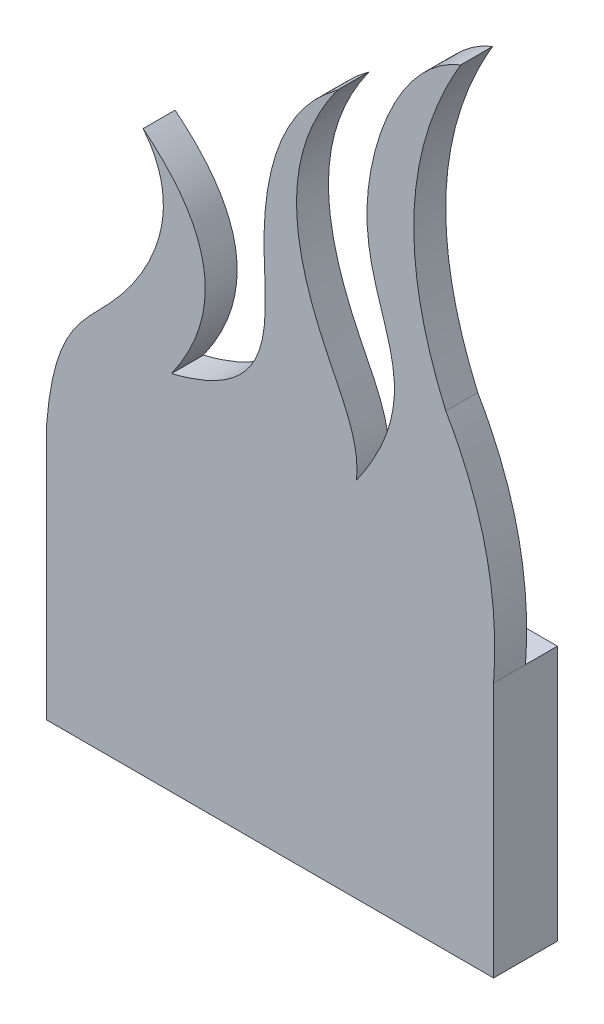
ISO-10303-21;
HEADER;
FILE_DESCRIPTION(('STEP AP214'),'2;1');
FILE_NAME('part.step','',(''),(''),'','','');
FILE_SCHEMA(('AUTOMOTIVE_DESIGN { 1 0 10303 214 1 1 1 1 }'));
ENDSEC;
DATA;
#1=APPLICATION_CONTEXT('core data for automotive mechanical design processes');
#2=APPLICATION_PROTOCOL_DEFINITION('international standard','automotive_design',2000,#1);
#3=PRODUCT_CONTEXT('',#1,'mechanical');
#4=PRODUCT('Part','Part','',(#3));
#5=PRODUCT_RELATED_PRODUCT_CATEGORY('part','',(#4));
#6=PRODUCT_DEFINITION_FORMATION('','',#4);
#7=PRODUCT_DEFINITION_CONTEXT('part definition',#1,'design');
#8=PRODUCT_DEFINITION('design','',#6,#7);
#9=PRODUCT_DEFINITION_SHAPE('','',#8);
#10=(LENGTH_UNIT() NAMED_UNIT(*) SI_UNIT(.MILLI.,.METRE.));
#11=(NAMED_UNIT(*) PLANE_ANGLE_UNIT() SI_UNIT($,.RADIAN.));
#12=(NAMED_UNIT(*) SI_UNIT($,.STERADIAN.) SOLID_ANGLE_UNIT());
#13=UNCERTAINTY_MEASURE_WITH_UNIT(LENGTH_MEASURE(1.E-05),#10,'distance_accuracy_value','');
#14=(GEOMETRIC_REPRESENTATION_CONTEXT(3) GLOBAL_UNCERTAINTY_ASSIGNED_CONTEXT((#13)) GLOBAL_UNIT_ASSIGNED_CONTEXT((#10,
#11,#12)) REPRESENTATION_CONTEXT('',''));
#15=CARTESIAN_POINT('',(0.,0.,0.));
#16=DIRECTION('',(0.,0.,1.));
#17=DIRECTION('',(1.,0.,0.));
#18=AXIS2_PLACEMENT_3D('',#15,#16,#17);
#19=CARTESIAN_POINT('',(22.225,25.4,3.175));
#20=DIRECTION('',(-1.,0.,0.));
#21=DIRECTION('',(0.,0.,1.));
#22=AXIS2_PLACEMENT_3D('',#19,#20,#21);
#23=PLANE('',#22);
#24=DIRECTION('',(0.,0.,-1.));
#25=VECTOR('',#24,1.);
#26=CARTESIAN_POINT('',(22.225,0.,3.175));
#27=LINE('',#26,#25);
#28=CARTESIAN_POINT('',(22.225,0.,3.175));
#29=VERTEX_POINT('',#28);
#30=CARTESIAN_POINT('',(22.225,0.,-3.175));
#31=VERTEX_POINT('',#30);
#32=EDGE_CURVE('E97',#29,#31,#27,.T.);
#33=ORIENTED_EDGE('',*,*,#32,.T.);
#34=DIRECTION('',(0.,-1.,0.));
#35=VECTOR('',#34,1.);
#36=CARTESIAN_POINT('',(22.225,25.4,-3.175));
#37=LINE('',#36,#35);
#38=CARTESIAN_POINT('',(22.225,25.4,-3.175));
#39=VERTEX_POINT('',#38);
#40=EDGE_CURVE('E11',#39,#31,#37,.T.);
#41=ORIENTED_EDGE('',*,*,#40,.F.);
#42=DIRECTION('',(0.,0.,-1.));
#43=VECTOR('',#42,1.);
#44=CARTESIAN_POINT('',(22.225,25.4,3.175));
#45=LINE('',#44,#43);
#46=CARTESIAN_POINT('',(22.225,25.4,0.));
#47=VERTEX_POINT('',#46);
#48=EDGE_CURVE('E91',#47,#39,#45,.T.);
#49=ORIENTED_EDGE('',*,*,#48,.F.);
#50=CARTESIAN_POINT('',(22.225,25.4,3.175));
#51=VERTEX_POINT('',#50);
#52=EDGE_CURVE('E99',#51,#47,#45,.T.);
#53=ORIENTED_EDGE('',*,*,#52,.F.);
#54=DIRECTION('',(0.,-1.,0.));
#55=VECTOR('',#54,1.);
#56=CARTESIAN_POINT('',(22.225,25.4,3.175));
#57=LINE('',#56,#55);
#58=EDGE_CURVE('E83',#51,#29,#57,.T.);
#59=ORIENTED_EDGE('',*,*,#58,.T.);
#60=EDGE_LOOP('',(#33,#41,#49,#53,#59));
#61=FACE_BOUND('',#60,.T.);
#62=ADVANCED_FACE('F32',(#61),#23,.F.);
#63=CARTESIAN_POINT('',(-22.225,25.4,-3.175));
#64=DIRECTION('',(0.,0.,1.));
#65=DIRECTION('',(1.,0.,0.));
#66=AXIS2_PLACEMENT_3D('',#63,#64,#65);
#67=PLANE('',#66);
#68=DIRECTION('',(-1.,0.,0.));
#69=VECTOR('',#68,1.);
#70=CARTESIAN_POINT('',(-22.225,0.,-3.175));
#71=LINE('',#70,#69);
#72=CARTESIAN_POINT('',(-22.225,0.,-3.175));
#73=VERTEX_POINT('',#72);
#74=EDGE_CURVE('E103',#31,#73,#71,.T.);
#75=ORIENTED_EDGE('',*,*,#74,.T.);
#76=DIRECTION('',(0.,-1.,0.));
#77=VECTOR('',#76,1.);
#78=CARTESIAN_POINT('',(-22.225,25.4,-3.175));
#79=LINE('',#78,#77);
#80=CARTESIAN_POINT('',(-22.225,25.4,-3.175));
#81=VERTEX_POINT('',#80);
#82=EDGE_CURVE('E41',#81,#73,#79,.T.);
#83=ORIENTED_EDGE('',*,*,#82,.F.);
#84=DIRECTION('',(-1.,0.,0.));
#85=VECTOR('',#84,1.);
#86=CARTESIAN_POINT('',(-22.225,25.4,-3.175));
#87=LINE('',#86,#85);
#88=EDGE_CURVE('E58',#39,#81,#87,.T.);
#89=ORIENTED_EDGE('',*,*,#88,.F.);
#90=ORIENTED_EDGE('',*,*,#40,.T.);
#91=EDGE_LOOP('',(#75,#83,#89,#90));
#92=FACE_BOUND('',#91,.T.);
#93=ADVANCED_FACE('F141',(#92),#67,.F.);
#94=CARTESIAN_POINT('',(-22.225,25.4,3.175));
#95=DIRECTION('',(1.,0.,0.));
#96=DIRECTION('',(0.,0.,-1.));
#97=AXIS2_PLACEMENT_3D('',#94,#95,#96);
#98=PLANE('',#97);
#99=DIRECTION('',(0.,0.,1.));
#100=VECTOR('',#99,1.);
#101=CARTESIAN_POINT('',(-22.225,0.,3.175));
#102=LINE('',#101,#100);
#103=CARTESIAN_POINT('',(-22.225,0.,3.175));
#104=VERTEX_POINT('',#103);
#105=EDGE_CURVE('E92',#73,#104,#102,.T.);
#106=ORIENTED_EDGE('',*,*,#105,.T.);
#107=DIRECTION('',(0.,-1.,0.));
#108=VECTOR('',#107,1.);
#109=CARTESIAN_POINT('',(-22.225,25.4,3.175));
#110=LINE('',#109,#108);
#111=CARTESIAN_POINT('',(-22.225,25.4,3.175));
#112=VERTEX_POINT('',#111);
#113=EDGE_CURVE('E87',#112,#104,#110,.T.);
#114=ORIENTED_EDGE('',*,*,#113,.F.);
#115=DIRECTION('',(0.,0.,1.));
#116=VECTOR('',#115,1.);
#117=CARTESIAN_POINT('',(-22.225,25.4,0.));
#118=LINE('',#117,#116);
#119=CARTESIAN_POINT('',(-22.225,25.4,0.));
#120=VERTEX_POINT('',#119);
#121=EDGE_CURVE('E146',#120,#112,#118,.T.);
#122=ORIENTED_EDGE('',*,*,#121,.F.);
#123=DIRECTION('',(0.,0.,1.));
#124=VECTOR('',#123,1.);
#125=CARTESIAN_POINT('',(-22.225,25.4,3.175));
#126=LINE('',#125,#124);
#127=EDGE_CURVE('E100',#81,#120,#126,.T.);
#128=ORIENTED_EDGE('',*,*,#127,.F.);
#129=ORIENTED_EDGE('',*,*,#82,.T.);
#130=EDGE_LOOP('',(#106,#114,#122,#128,#129));
#131=FACE_BOUND('',#130,.T.);
#132=ADVANCED_FACE('F144',(#131),#98,.F.);
#133=CARTESIAN_POINT('',(-22.225,25.4,3.175));
#134=DIRECTION('',(0.,0.,-1.));
#135=DIRECTION('',(-1.,0.,0.));
#136=AXIS2_PLACEMENT_3D('',#133,#134,#135);
#137=PLANE('',#136);
#138=DIRECTION('',(1.,0.,0.));
#139=VECTOR('',#138,1.);
#140=CARTESIAN_POINT('',(-22.225,0.,3.175));
#141=LINE('',#140,#139);
#142=EDGE_CURVE('E78',#104,#29,#141,.T.);
#143=ORIENTED_EDGE('',*,*,#142,.T.);
#144=ORIENTED_EDGE('',*,*,#58,.F.);
#145=CARTESIAN_POINT('',(22.225,25.4,3.175));
#146=CARTESIAN_POINT('',(23.0800751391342,36.8267192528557,3.175));
#147=CARTESIAN_POINT('',(17.4738113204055,46.4480839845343,3.175));
#148=B_SPLINE_CURVE_WITH_KNOTS('',2,(#145,#146,#147),.UNSPECIFIED.,.F.,.F.,(3,3),(0.,1.),.UNSPECIFIED.);
#149=CARTESIAN_POINT('',(17.4738113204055,46.4480839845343,3.175));
#150=VERTEX_POINT('',#149);
#151=EDGE_CURVE('E132',#51,#150,#148,.T.);
#152=ORIENTED_EDGE('',*,*,#151,.T.);
#153=CARTESIAN_POINT('',(17.4738113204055,46.4480839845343,3.175));
#154=CARTESIAN_POINT('',(10.4367289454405,62.5991459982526,3.175));
#155=CARTESIAN_POINT('',(18.960709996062,76.9990173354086,3.175));
#156=B_SPLINE_CURVE_WITH_KNOTS('',2,(#153,#154,#155),.UNSPECIFIED.,.F.,.F.,(3,3),(0.,1.),.UNSPECIFIED.);
#157=CARTESIAN_POINT('',(18.960709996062,76.9990173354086,3.175));
#158=VERTEX_POINT('',#157);
#159=EDGE_CURVE('E322',#150,#158,#156,.T.);
#160=ORIENTED_EDGE('',*,*,#159,.T.);
#161=CARTESIAN_POINT('',(18.960709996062,76.9990173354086,3.175));
#162=CARTESIAN_POINT('',(12.901403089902,74.6241088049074,3.175));
#163=CARTESIAN_POINT('',(4.88591670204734,52.4211996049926,3.175));
#164=CARTESIAN_POINT('',(16.5310467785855,47.4203582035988,3.175));
#165=CARTESIAN_POINT('',(8.59367185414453,36.0374221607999,3.175));
#166=B_SPLINE_CURVE_WITH_KNOTS('',3,(#161,#162,#163,#164,#165),.UNSPECIFIED.,.F.,.F.,(4,1,4),
(0.,0.391660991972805,1.),.UNSPECIFIED.);
#167=CARTESIAN_POINT('',(8.59367185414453,36.0374221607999,3.175));
#168=VERTEX_POINT('',#167);
#169=EDGE_CURVE('E330',#158,#168,#166,.T.);
#170=ORIENTED_EDGE('',*,*,#169,.T.);
#171=CARTESIAN_POINT('',(8.59367185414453,36.0374221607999,3.175));
#172=CARTESIAN_POINT('',(8.97711005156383,39.5089428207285,3.175));
#173=CARTESIAN_POINT('',(2.71754921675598,49.6184292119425,3.175));
#174=CARTESIAN_POINT('',(0.789934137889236,60.4670703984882,3.175));
#175=CARTESIAN_POINT('',(6.67759912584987,68.6745276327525,3.175));
#176=B_SPLINE_CURVE_WITH_KNOTS('',3,(#171,#172,#173,#174,#175),.UNSPECIFIED.,.F.,.F.,(4,1,4),
(0.,0.301959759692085,1.),.UNSPECIFIED.);
#177=CARTESIAN_POINT('',(6.67759912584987,68.6745276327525,3.175));
#178=VERTEX_POINT('',#177);
#179=EDGE_CURVE('E338',#168,#178,#176,.T.);
#180=ORIENTED_EDGE('',*,*,#179,.T.);
#181=CARTESIAN_POINT('',(6.67759912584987,68.6745276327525,3.175));
#182=CARTESIAN_POINT('',(1.17784500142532,64.6986703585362,3.175));
#183=CARTESIAN_POINT('',(-2.46619862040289,51.726212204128,3.175));
#184=CARTESIAN_POINT('',(1.34434864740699,38.7798701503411,3.175));
#185=CARTESIAN_POINT('',(-9.80062633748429,36.0374221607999,3.175));
#186=B_SPLINE_CURVE_WITH_KNOTS('',3,(#181,#182,#183,#184,#185),.UNSPECIFIED.,.F.,.F.,(4,1,4),
(0.,0.489507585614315,1.),.UNSPECIFIED.);
#187=CARTESIAN_POINT('',(-9.80062633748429,36.0374221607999,3.175));
#188=VERTEX_POINT('',#187);
#189=EDGE_CURVE('E346',#178,#188,#186,.T.);
#190=ORIENTED_EDGE('',*,*,#189,.T.);
#191=CARTESIAN_POINT('',(-9.80062633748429,36.0374221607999,3.175));
#192=CARTESIAN_POINT('',(-1.8987413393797,47.1770082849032,3.175));
#193=CARTESIAN_POINT('',(-12.6199371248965,55.7228099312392,3.175));
#194=B_SPLINE_CURVE_WITH_KNOTS('',2,(#191,#192,#193),.UNSPECIFIED.,.F.,.F.,(3,3),(0.,1.),.UNSPECIFIED.);
#195=CARTESIAN_POINT('',(-12.6199371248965,55.7228099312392,3.175));
#196=VERTEX_POINT('',#195);
#197=EDGE_CURVE('E354',#188,#196,#194,.T.);
#198=ORIENTED_EDGE('',*,*,#197,.T.);
#199=CARTESIAN_POINT('',(-12.6199371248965,55.7228099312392,3.175));
#200=CARTESIAN_POINT('',(-8.24592435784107,50.329924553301,3.175));
#201=CARTESIAN_POINT('',(-15.3058509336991,37.3798364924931,3.175));
#202=CARTESIAN_POINT('',(-21.4642868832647,34.8643002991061,3.175));
#203=CARTESIAN_POINT('',(-22.225,25.4,3.175));
#204=B_SPLINE_CURVE_WITH_KNOTS('',3,(#199,#200,#201,#202,#203),.UNSPECIFIED.,.F.,.F.,(4,1,4),
(0.,0.516123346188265,1.),.UNSPECIFIED.);
#205=EDGE_CURVE('E309',#196,#112,#204,.T.);
#206=ORIENTED_EDGE('',*,*,#205,.T.);
#207=ORIENTED_EDGE('',*,*,#113,.T.);
#208=EDGE_LOOP('',(#143,#144,#152,#160,#170,#180,#190,#198,#206,#207));
#209=FACE_BOUND('',#208,.T.);
#210=ADVANCED_FACE('F80',(#209),#137,.F.);
#211=CARTESIAN_POINT('',(22.225,25.4,-3.175));
#212=DIRECTION('',(0.,-1.,0.));
#213=DIRECTION('',(0.,0.,-1.));
#214=AXIS2_PLACEMENT_3D('',#211,#212,#213);
#215=PLANE('',#214);
#216=ORIENTED_EDGE('',*,*,#127,.T.);
#217=DIRECTION('',(1.,0.,0.));
#218=VECTOR('',#217,1.);
#219=CARTESIAN_POINT('',(-22.225,25.4,0.));
#220=LINE('',#219,#218);
#221=EDGE_CURVE('E133',#120,#47,#220,.T.);
#222=ORIENTED_EDGE('',*,*,#221,.T.);
#223=ORIENTED_EDGE('',*,*,#48,.T.);
#224=ORIENTED_EDGE('',*,*,#88,.T.);
#225=EDGE_LOOP('',(#216,#222,#223,#224));
#226=FACE_BOUND('',#225,.T.);
#227=ADVANCED_FACE('F134',(#226),#215,.F.);
#228=CARTESIAN_POINT('',(22.225,0.,-3.175));
#229=DIRECTION('',(0.,-1.,0.));
#230=DIRECTION('',(0.,0.,-1.));
#231=AXIS2_PLACEMENT_3D('',#228,#229,#230);
#232=PLANE('',#231);
#233=ORIENTED_EDGE('',*,*,#32,.F.);
#234=ORIENTED_EDGE('',*,*,#142,.F.);
#235=ORIENTED_EDGE('',*,*,#105,.F.);
#236=ORIENTED_EDGE('',*,*,#74,.F.);
#237=EDGE_LOOP('',(#233,#234,#235,#236));
#238=FACE_BOUND('',#237,.T.);
#239=ADVANCED_FACE('F102',(#238),#232,.T.);
#240=CARTESIAN_POINT('',(-12.6199371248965,55.7228099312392,0.));
#241=CARTESIAN_POINT('',(-8.24592435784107,50.329924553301,0.));
#242=CARTESIAN_POINT('',(-15.3058509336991,37.3798364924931,0.));
#243=CARTESIAN_POINT('',(-21.4642868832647,34.8643002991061,0.));
#244=CARTESIAN_POINT('',(-22.225,25.4,0.));
#245=B_SPLINE_CURVE_WITH_KNOTS('',3,(#240,#241,#242,#243,#244),.UNSPECIFIED.,.F.,.F.,(4,1,4),
(0.,0.516123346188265,1.),.UNSPECIFIED.);
#246=DIRECTION('',(0.,0.,1.));
#247=VECTOR('',#246,1.);
#248=SURFACE_OF_LINEAR_EXTRUSION('',#245,#247);
#249=ORIENTED_EDGE('',*,*,#205,.F.);
#250=DIRECTION('',(0.,0.,1.));
#251=VECTOR('',#250,1.);
#252=CARTESIAN_POINT('',(-12.6199371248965,55.7228099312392,0.));
#253=LINE('',#252,#251);
#254=CARTESIAN_POINT('',(-12.6199371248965,55.7228099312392,0.));
#255=VERTEX_POINT('',#254);
#256=EDGE_CURVE('E104',#255,#196,#253,.T.);
#257=ORIENTED_EDGE('',*,*,#256,.F.);
#258=EDGE_CURVE('E35',#255,#120,#245,.T.);
#259=ORIENTED_EDGE('',*,*,#258,.T.);
#260=ORIENTED_EDGE('',*,*,#121,.T.);
#261=EDGE_LOOP('',(#249,#257,#259,#260));
#262=FACE_BOUND('',#261,.T.);
#263=ADVANCED_FACE('F183',(#262),#248,.T.);
#264=CARTESIAN_POINT('',(-9.80062633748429,36.0374221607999,0.));
#265=CARTESIAN_POINT('',(-1.8987413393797,47.1770082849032,0.));
#266=CARTESIAN_POINT('',(-12.6199371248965,55.7228099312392,0.));
#267=B_SPLINE_CURVE_WITH_KNOTS('',2,(#264,#265,#266),.UNSPECIFIED.,.F.,.F.,(3,3),(0.,1.),.UNSPECIFIED.);
#268=DIRECTION('',(0.,0.,1.));
#269=VECTOR('',#268,1.);
#270=SURFACE_OF_LINEAR_EXTRUSION('',#267,#269);
#271=ORIENTED_EDGE('',*,*,#197,.F.);
#272=DIRECTION('',(0.,0.,1.));
#273=VECTOR('',#272,1.);
#274=CARTESIAN_POINT('',(-9.80062633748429,36.0374221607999,0.));
#275=LINE('',#274,#273);
#276=CARTESIAN_POINT('',(-9.80062633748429,36.0374221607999,0.));
#277=VERTEX_POINT('',#276);
#278=EDGE_CURVE('E108',#277,#188,#275,.T.);
#279=ORIENTED_EDGE('',*,*,#278,.F.);
#280=EDGE_CURVE('E152',#277,#255,#267,.T.);
#281=ORIENTED_EDGE('',*,*,#280,.T.);
#282=ORIENTED_EDGE('',*,*,#256,.T.);
#283=EDGE_LOOP('',(#271,#279,#281,#282));
#284=FACE_BOUND('',#283,.T.);
#285=ADVANCED_FACE('F186',(#284),#270,.T.);
#286=CARTESIAN_POINT('',(6.67759912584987,68.6745276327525,0.));
#287=CARTESIAN_POINT('',(1.17784500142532,64.6986703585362,0.));
#288=CARTESIAN_POINT('',(-2.46619862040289,51.726212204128,0.));
#289=CARTESIAN_POINT('',(1.34434864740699,38.7798701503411,0.));
#290=CARTESIAN_POINT('',(-9.80062633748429,36.0374221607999,0.));
#291=B_SPLINE_CURVE_WITH_KNOTS('',3,(#286,#287,#288,#289,#290),.UNSPECIFIED.,.F.,.F.,(4,1,4),
(0.,0.489507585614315,1.),.UNSPECIFIED.);
#292=DIRECTION('',(0.,0.,1.));
#293=VECTOR('',#292,1.);
#294=SURFACE_OF_LINEAR_EXTRUSION('',#291,#293);
#295=ORIENTED_EDGE('',*,*,#189,.F.);
#296=DIRECTION('',(0.,0.,1.));
#297=VECTOR('',#296,1.);
#298=CARTESIAN_POINT('',(6.67759912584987,68.6745276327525,0.));
#299=LINE('',#298,#297);
#300=CARTESIAN_POINT('',(6.67759912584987,68.6745276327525,0.));
#301=VERTEX_POINT('',#300);
#302=EDGE_CURVE('E367',#301,#178,#299,.T.);
#303=ORIENTED_EDGE('',*,*,#302,.F.);
#304=EDGE_CURVE('E156',#301,#277,#291,.T.);
#305=ORIENTED_EDGE('',*,*,#304,.T.);
#306=ORIENTED_EDGE('',*,*,#278,.T.);
#307=EDGE_LOOP('',(#295,#303,#305,#306));
#308=FACE_BOUND('',#307,.T.);
#309=ADVANCED_FACE('F245',(#308),#294,.T.);
#310=CARTESIAN_POINT('',(8.59367185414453,36.0374221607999,0.));
#311=CARTESIAN_POINT('',(8.97711005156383,39.5089428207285,0.));
#312=CARTESIAN_POINT('',(2.71754921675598,49.6184292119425,0.));
#313=CARTESIAN_POINT('',(0.789934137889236,60.4670703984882,0.));
#314=CARTESIAN_POINT('',(6.67759912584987,68.6745276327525,0.));
#315=B_SPLINE_CURVE_WITH_KNOTS('',3,(#310,#311,#312,#313,#314),.UNSPECIFIED.,.F.,.F.,(4,1,4),
(0.,0.301959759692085,1.),.UNSPECIFIED.);
#316=DIRECTION('',(0.,0.,1.));
#317=VECTOR('',#316,1.);
#318=SURFACE_OF_LINEAR_EXTRUSION('',#315,#317);
#319=ORIENTED_EDGE('',*,*,#179,.F.);
#320=DIRECTION('',(0.,0.,1.));
#321=VECTOR('',#320,1.);
#322=CARTESIAN_POINT('',(8.59367185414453,36.0374221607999,0.));
#323=LINE('',#322,#321);
#324=CARTESIAN_POINT('',(8.59367185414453,36.0374221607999,0.));
#325=VERTEX_POINT('',#324);
#326=EDGE_CURVE('E370',#325,#168,#323,.T.);
#327=ORIENTED_EDGE('',*,*,#326,.F.);
#328=EDGE_CURVE('E414',#325,#301,#315,.T.);
#329=ORIENTED_EDGE('',*,*,#328,.T.);
#330=ORIENTED_EDGE('',*,*,#302,.T.);
#331=EDGE_LOOP('',(#319,#327,#329,#330));
#332=FACE_BOUND('',#331,.T.);
#333=ADVANCED_FACE('F255',(#332),#318,.T.);
#334=CARTESIAN_POINT('',(18.960709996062,76.9990173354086,0.));
#335=CARTESIAN_POINT('',(12.901403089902,74.6241088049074,0.));
#336=CARTESIAN_POINT('',(4.88591670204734,52.4211996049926,0.));
#337=CARTESIAN_POINT('',(16.5310467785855,47.4203582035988,0.));
#338=CARTESIAN_POINT('',(8.59367185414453,36.0374221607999,0.));
#339=B_SPLINE_CURVE_WITH_KNOTS('',3,(#334,#335,#336,#337,#338),.UNSPECIFIED.,.F.,.F.,(4,1,4),
(0.,0.391660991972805,1.),.UNSPECIFIED.);
#340=DIRECTION('',(0.,0.,1.));
#341=VECTOR('',#340,1.);
#342=SURFACE_OF_LINEAR_EXTRUSION('',#339,#341);
#343=ORIENTED_EDGE('',*,*,#169,.F.);
#344=DIRECTION('',(0.,0.,1.));
#345=VECTOR('',#344,1.);
#346=CARTESIAN_POINT('',(18.960709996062,76.9990173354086,0.));
#347=LINE('',#346,#345);
#348=CARTESIAN_POINT('',(18.960709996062,76.9990173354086,0.));
#349=VERTEX_POINT('',#348);
#350=EDGE_CURVE('E154',#349,#158,#347,.T.);
#351=ORIENTED_EDGE('',*,*,#350,.F.);
#352=EDGE_CURVE('E413',#349,#325,#339,.T.);
#353=ORIENTED_EDGE('',*,*,#352,.T.);
#354=ORIENTED_EDGE('',*,*,#326,.T.);
#355=EDGE_LOOP('',(#343,#351,#353,#354));
#356=FACE_BOUND('',#355,.T.);
#357=ADVANCED_FACE('F265',(#356),#342,.T.);
#358=CARTESIAN_POINT('',(17.4738113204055,46.4480839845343,0.));
#359=CARTESIAN_POINT('',(10.4367289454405,62.5991459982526,0.));
#360=CARTESIAN_POINT('',(18.960709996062,76.9990173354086,0.));
#361=B_SPLINE_CURVE_WITH_KNOTS('',2,(#358,#359,#360),.UNSPECIFIED.,.F.,.F.,(3,3),(0.,1.),.UNSPECIFIED.);
#362=DIRECTION('',(0.,0.,1.));
#363=VECTOR('',#362,1.);
#364=SURFACE_OF_LINEAR_EXTRUSION('',#361,#363);
#365=ORIENTED_EDGE('',*,*,#159,.F.);
#366=DIRECTION('',(0.,0.,1.));
#367=VECTOR('',#366,1.);
#368=CARTESIAN_POINT('',(17.4738113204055,46.4480839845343,0.));
#369=LINE('',#368,#367);
#370=CARTESIAN_POINT('',(17.4738113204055,46.4480839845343,0.));
#371=VERTEX_POINT('',#370);
#372=EDGE_CURVE('E123',#371,#150,#369,.T.);
#373=ORIENTED_EDGE('',*,*,#372,.F.);
#374=EDGE_CURVE('E161',#371,#349,#361,.T.);
#375=ORIENTED_EDGE('',*,*,#374,.T.);
#376=ORIENTED_EDGE('',*,*,#350,.T.);
#377=EDGE_LOOP('',(#365,#373,#375,#376));
#378=FACE_BOUND('',#377,.T.);
#379=ADVANCED_FACE('F181',(#378),#364,.T.);
#380=CARTESIAN_POINT('',(22.225,25.4,0.));
#381=CARTESIAN_POINT('',(23.0800751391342,36.8267192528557,0.));
#382=CARTESIAN_POINT('',(17.4738113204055,46.4480839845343,0.));
#383=B_SPLINE_CURVE_WITH_KNOTS('',2,(#380,#381,#382),.UNSPECIFIED.,.F.,.F.,(3,3),(0.,1.),.UNSPECIFIED.);
#384=DIRECTION('',(0.,0.,1.));
#385=VECTOR('',#384,1.);
#386=SURFACE_OF_LINEAR_EXTRUSION('',#383,#385);
#387=ORIENTED_EDGE('',*,*,#151,.F.);
#388=ORIENTED_EDGE('',*,*,#52,.T.);
#389=EDGE_CURVE('E49',#47,#371,#383,.T.);
#390=ORIENTED_EDGE('',*,*,#389,.T.);
#391=ORIENTED_EDGE('',*,*,#372,.T.);
#392=EDGE_LOOP('',(#387,#388,#390,#391));
#393=FACE_BOUND('',#392,.T.);
#394=ADVANCED_FACE('F129',(#393),#386,.T.);
#395=CARTESIAN_POINT('',(-14.9739335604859,40.1157417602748,0.));
#396=DIRECTION('',(0.,0.,1.));
#397=DIRECTION('',(1.,0.,0.));
#398=AXIS2_PLACEMENT_3D('',#395,#396,#397);
#399=PLANE('',#398);
#400=ORIENTED_EDGE('',*,*,#258,.F.);
#401=ORIENTED_EDGE('',*,*,#280,.F.);
#402=ORIENTED_EDGE('',*,*,#304,.F.);
#403=ORIENTED_EDGE('',*,*,#328,.F.);
#404=ORIENTED_EDGE('',*,*,#352,.F.);
#405=ORIENTED_EDGE('',*,*,#374,.F.);
#406=ORIENTED_EDGE('',*,*,#389,.F.);
#407=ORIENTED_EDGE('',*,*,#221,.F.);
#408=EDGE_LOOP('',(#400,#401,#402,#403,#404,#405,#406,#407));
#409=FACE_BOUND('',#408,.T.);
#410=ADVANCED_FACE('F180',(#409),#399,.F.);
#411=CLOSED_SHELL('',(#62,#93,#132,#210,#227,#239,#263,#285,#309,#333,#357,#379,#394,#410));
#412=MANIFOLD_SOLID_BREP('B2',#411);
#413=ADVANCED_BREP_SHAPE_REPRESENTATION('',(#18,#412),#14);
#414=SHAPE_DEFINITION_REPRESENTATION(#9,#413);
ENDSEC;
END-ISO-10303-21;
